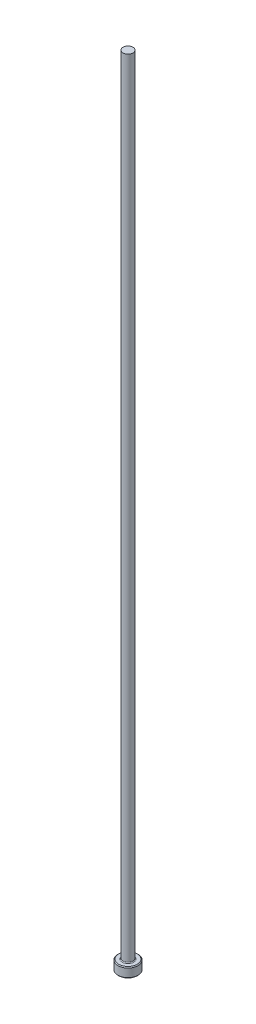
from build123d import *

# Parameters (mm, degrees)
CHAMFER1_SIZE = 0.254
FILLET1_R     = 0.254


with BuildPart() as part:
    # Sketch1 → Revolve1 (revolve)
    with BuildSketch(Plane.XY, mode=Mode.PRIVATE) as revolve1_sk:
        Polygon((0, 0), (-3.175, 0), (-3.175, 3.175), (-1.5875, 3.175), (-1.5875, 254), (0, 254), align=None)
    revolve(revolve1_sk.sketch.rotate(Axis((0, 259.958771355, 0), (0, -1, 0)), 270), axis=Axis((0, 259.958771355, 0), (0, -1, 0)))

    # Chamfer1
    chamfer1_edges = [part.edges().sort_by_distance(p)[0] for p in [
        (0, 3.175, -3.175),
        (0, 0, -3.175),
    ]]
    chamfer(chamfer1_edges, length=CHAMFER1_SIZE)

    # Fillet1
    fillet1_edges = [part.edges().sort_by_distance(p)[0] for p in [
        (0, 3.175, -1.5875),
    ]]
    fillet(fillet1_edges, radius=FILLET1_R)


solid = part.part
